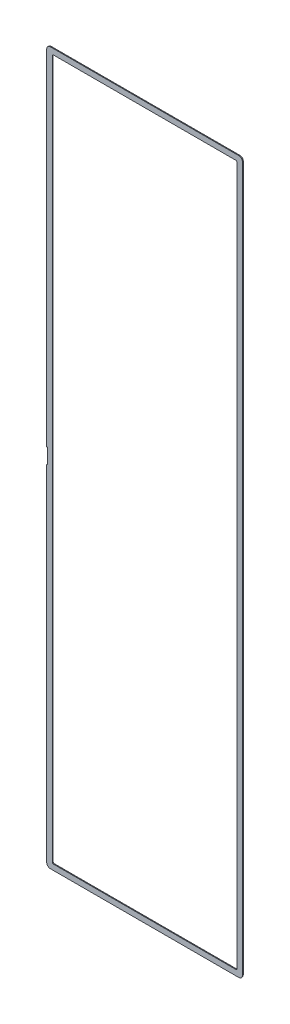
ISO-10303-21;
HEADER;
FILE_DESCRIPTION(('STEP AP214'),'2;1');
FILE_NAME('part.step','',(''),(''),'','','');
FILE_SCHEMA(('AUTOMOTIVE_DESIGN { 1 0 10303 214 1 1 1 1 }'));
ENDSEC;
DATA;
#1=APPLICATION_CONTEXT('core data for automotive mechanical design processes');
#2=APPLICATION_PROTOCOL_DEFINITION('international standard','automotive_design',2000,#1);
#3=PRODUCT_CONTEXT('',#1,'mechanical');
#4=PRODUCT('Part','Part','',(#3));
#5=PRODUCT_RELATED_PRODUCT_CATEGORY('part','',(#4));
#6=PRODUCT_DEFINITION_FORMATION('','',#4);
#7=PRODUCT_DEFINITION_CONTEXT('part definition',#1,'design');
#8=PRODUCT_DEFINITION('design','',#6,#7);
#9=PRODUCT_DEFINITION_SHAPE('','',#8);
#10=(LENGTH_UNIT() NAMED_UNIT(*) SI_UNIT(.MILLI.,.METRE.));
#11=(NAMED_UNIT(*) PLANE_ANGLE_UNIT() SI_UNIT($,.RADIAN.));
#12=(NAMED_UNIT(*) SI_UNIT($,.STERADIAN.) SOLID_ANGLE_UNIT());
#13=UNCERTAINTY_MEASURE_WITH_UNIT(LENGTH_MEASURE(1.E-05),#10,'distance_accuracy_value','');
#14=(GEOMETRIC_REPRESENTATION_CONTEXT(3) GLOBAL_UNCERTAINTY_ASSIGNED_CONTEXT((#13)) GLOBAL_UNIT_ASSIGNED_CONTEXT((#10,
#11,#12)) REPRESENTATION_CONTEXT('',''));
#15=CARTESIAN_POINT('',(0.,0.,0.));
#16=DIRECTION('',(0.,0.,1.));
#17=DIRECTION('',(1.,0.,0.));
#18=AXIS2_PLACEMENT_3D('',#15,#16,#17);
#19=CARTESIAN_POINT('',(-265.5,-955.5,4.));
#20=DIRECTION('',(1.,0.,0.));
#21=DIRECTION('',(0.,0.,-1.));
#22=AXIS2_PLACEMENT_3D('',#19,#20,#21);
#23=PLANE('',#22);
#24=DIRECTION('',(0.,-1.,0.));
#25=VECTOR('',#24,1.);
#26=CARTESIAN_POINT('',(-265.5,-955.5,4.));
#27=LINE('',#26,#25);
#28=CARTESIAN_POINT('',(-265.5,-20.5000000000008,4.));
#29=VERTEX_POINT('',#28);
#30=CARTESIAN_POINT('',(-265.5,-955.5,4.));
#31=VERTEX_POINT('',#30);
#32=EDGE_CURVE('E275',#29,#31,#27,.T.);
#33=ORIENTED_EDGE('',*,*,#32,.F.);
#34=DIRECTION('',(0.,0.,-1.));
#35=VECTOR('',#34,1.);
#36=CARTESIAN_POINT('',(-265.5,-20.5000000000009,4.));
#37=LINE('',#36,#35);
#38=CARTESIAN_POINT('',(-265.5,-20.5000000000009,3.));
#39=VERTEX_POINT('',#38);
#40=EDGE_CURVE('E243',#29,#39,#37,.T.);
#41=ORIENTED_EDGE('',*,*,#40,.T.);
#42=DIRECTION('',(0.,-1.,0.));
#43=VECTOR('',#42,1.);
#44=CARTESIAN_POINT('',(-265.5,-955.5,3.));
#45=LINE('',#44,#43);
#46=CARTESIAN_POINT('',(-265.5,-955.5,3.));
#47=VERTEX_POINT('',#46);
#48=EDGE_CURVE('E341',#39,#47,#45,.T.);
#49=ORIENTED_EDGE('',*,*,#48,.T.);
#50=DIRECTION('',(0.,0.,-1.));
#51=VECTOR('',#50,1.);
#52=CARTESIAN_POINT('',(-265.5,-955.5,4.));
#53=LINE('',#52,#51);
#54=EDGE_CURVE('E277',#31,#47,#53,.T.);
#55=ORIENTED_EDGE('',*,*,#54,.F.);
#56=EDGE_LOOP('',(#33,#41,#49,#55));
#57=FACE_BOUND('',#56,.T.);
#58=ADVANCED_FACE('F32',(#57),#23,.F.);
#59=CARTESIAN_POINT('',(-255.5,-955.5,0.));
#60=DIRECTION('',(0.,0.,-1.));
#61=DIRECTION('',(-1.,0.,0.));
#62=AXIS2_PLACEMENT_3D('',#59,#60,#61);
#63=PLANE('',#62);
#64=DIRECTION('',(1.,0.,0.));
#65=VECTOR('',#64,1.);
#66=CARTESIAN_POINT('',(-255.5,-962.5,0.));
#67=LINE('',#66,#65);
#68=CARTESIAN_POINT('',(255.5,-962.5,0.));
#69=VERTEX_POINT('',#68);
#70=CARTESIAN_POINT('',(-255.5,-962.5,0.));
#71=VERTEX_POINT('',#70);
#72=EDGE_CURVE('E324',#69,#71,#67,.F.);
#73=ORIENTED_EDGE('',*,*,#72,.T.);
#74=CARTESIAN_POINT('',(-255.5,-955.5,0.));
#75=DIRECTION('',(0.,0.,-1.));
#76=DIRECTION('',(-1.,0.,0.));
#77=AXIS2_PLACEMENT_3D('',#74,#75,#76);
#78=CIRCLE('',#77,7.00000000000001);
#79=CARTESIAN_POINT('',(-262.5,-955.5,0.));
#80=VERTEX_POINT('',#79);
#81=EDGE_CURVE('E338',#71,#80,#78,.T.);
#82=ORIENTED_EDGE('',*,*,#81,.T.);
#83=DIRECTION('',(0.,-1.,0.));
#84=VECTOR('',#83,1.);
#85=CARTESIAN_POINT('',(-262.5,955.5,0.));
#86=LINE('',#85,#84);
#87=CARTESIAN_POINT('',(-262.5,955.5,0.));
#88=VERTEX_POINT('',#87);
#89=EDGE_CURVE('E336',#80,#88,#86,.F.);
#90=ORIENTED_EDGE('',*,*,#89,.T.);
#91=CARTESIAN_POINT('',(-255.5,955.5,0.));
#92=DIRECTION('',(0.,0.,-1.));
#93=DIRECTION('',(-1.,0.,0.));
#94=AXIS2_PLACEMENT_3D('',#91,#92,#93);
#95=CIRCLE('',#94,7.00000000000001);
#96=CARTESIAN_POINT('',(-255.5,962.5,0.));
#97=VERTEX_POINT('',#96);
#98=EDGE_CURVE('E334',#88,#97,#95,.T.);
#99=ORIENTED_EDGE('',*,*,#98,.T.);
#100=DIRECTION('',(-1.,0.,0.));
#101=VECTOR('',#100,1.);
#102=CARTESIAN_POINT('',(255.5,962.5,0.));
#103=LINE('',#102,#101);
#104=CARTESIAN_POINT('',(255.5,962.5,0.));
#105=VERTEX_POINT('',#104);
#106=EDGE_CURVE('E332',#97,#105,#103,.F.);
#107=ORIENTED_EDGE('',*,*,#106,.T.);
#108=CARTESIAN_POINT('',(255.5,955.5,0.));
#109=DIRECTION('',(0.,0.,-1.));
#110=DIRECTION('',(-1.,0.,0.));
#111=AXIS2_PLACEMENT_3D('',#108,#109,#110);
#112=CIRCLE('',#111,7.00000000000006);
#113=CARTESIAN_POINT('',(262.5,955.5,0.));
#114=VERTEX_POINT('',#113);
#115=EDGE_CURVE('E330',#105,#114,#112,.T.);
#116=ORIENTED_EDGE('',*,*,#115,.T.);
#117=DIRECTION('',(0.,1.,0.));
#118=VECTOR('',#117,1.);
#119=CARTESIAN_POINT('',(262.5,-955.5,0.));
#120=LINE('',#119,#118);
#121=CARTESIAN_POINT('',(262.5,-955.5,0.));
#122=VERTEX_POINT('',#121);
#123=EDGE_CURVE('E328',#114,#122,#120,.F.);
#124=ORIENTED_EDGE('',*,*,#123,.T.);
#125=CARTESIAN_POINT('',(255.5,-955.5,0.));
#126=DIRECTION('',(0.,0.,-1.));
#127=DIRECTION('',(-1.,0.,0.));
#128=AXIS2_PLACEMENT_3D('',#125,#126,#127);
#129=CIRCLE('',#128,7.00000000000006);
#130=EDGE_CURVE('E326',#122,#69,#129,.T.);
#131=ORIENTED_EDGE('',*,*,#130,.T.);
#132=EDGE_LOOP('',(#73,#82,#90,#99,#107,#116,#124,#131));
#133=FACE_BOUND('',#132,.T.);
#134=CARTESIAN_POINT('',(-247.5,-947.5,0.));
#135=DIRECTION('',(0.,0.,-1.));
#136=DIRECTION('',(-1.,0.,0.));
#137=AXIS2_PLACEMENT_3D('',#134,#135,#136);
#138=CIRCLE('',#137,6.);
#139=CARTESIAN_POINT('',(-247.5,-953.5,0.));
#140=VERTEX_POINT('',#139);
#141=CARTESIAN_POINT('',(-253.5,-947.5,0.));
#142=VERTEX_POINT('',#141);
#143=EDGE_CURVE('E321',#140,#142,#138,.T.);
#144=ORIENTED_EDGE('',*,*,#143,.F.);
#145=DIRECTION('',(1.,0.,0.));
#146=VECTOR('',#145,1.);
#147=CARTESIAN_POINT('',(-255.5,-953.5,0.));
#148=LINE('',#147,#146);
#149=CARTESIAN_POINT('',(247.5,-953.5,0.));
#150=VERTEX_POINT('',#149);
#151=EDGE_CURVE('E318',#140,#150,#148,.T.);
#152=ORIENTED_EDGE('',*,*,#151,.T.);
#153=CARTESIAN_POINT('',(247.5,-947.5,0.));
#154=DIRECTION('',(0.,0.,-1.));
#155=DIRECTION('',(-1.,0.,0.));
#156=AXIS2_PLACEMENT_3D('',#153,#154,#155);
#157=CIRCLE('',#156,6.);
#158=CARTESIAN_POINT('',(253.5,-947.5,0.));
#159=VERTEX_POINT('',#158);
#160=EDGE_CURVE('E316',#159,#150,#157,.T.);
#161=ORIENTED_EDGE('',*,*,#160,.F.);
#162=DIRECTION('',(0.,1.,0.));
#163=VECTOR('',#162,1.);
#164=CARTESIAN_POINT('',(253.5,-955.5,0.));
#165=LINE('',#164,#163);
#166=CARTESIAN_POINT('',(253.5,947.5,0.));
#167=VERTEX_POINT('',#166);
#168=EDGE_CURVE('E312',#159,#167,#165,.T.);
#169=ORIENTED_EDGE('',*,*,#168,.T.);
#170=CARTESIAN_POINT('',(247.5,947.5,0.));
#171=DIRECTION('',(0.,0.,-1.));
#172=DIRECTION('',(-1.,0.,0.));
#173=AXIS2_PLACEMENT_3D('',#170,#171,#172);
#174=CIRCLE('',#173,6.);
#175=CARTESIAN_POINT('',(247.5,953.5,0.));
#176=VERTEX_POINT('',#175);
#177=EDGE_CURVE('E309',#176,#167,#174,.T.);
#178=ORIENTED_EDGE('',*,*,#177,.F.);
#179=DIRECTION('',(-1.,0.,0.));
#180=VECTOR('',#179,1.);
#181=CARTESIAN_POINT('',(-255.5,953.5,0.));
#182=LINE('',#181,#180);
#183=CARTESIAN_POINT('',(-247.5,953.5,0.));
#184=VERTEX_POINT('',#183);
#185=EDGE_CURVE('E307',#176,#184,#182,.T.);
#186=ORIENTED_EDGE('',*,*,#185,.T.);
#187=CARTESIAN_POINT('',(-247.5,947.5,0.));
#188=DIRECTION('',(0.,0.,-1.));
#189=DIRECTION('',(-1.,0.,0.));
#190=AXIS2_PLACEMENT_3D('',#187,#188,#189);
#191=CIRCLE('',#190,6.);
#192=CARTESIAN_POINT('',(-253.5,947.5,0.));
#193=VERTEX_POINT('',#192);
#194=EDGE_CURVE('E304',#193,#184,#191,.T.);
#195=ORIENTED_EDGE('',*,*,#194,.F.);
#196=DIRECTION('',(0.,-1.,0.));
#197=VECTOR('',#196,1.);
#198=CARTESIAN_POINT('',(-253.5,-955.5,0.));
#199=LINE('',#198,#197);
#200=EDGE_CURVE('E314',#193,#142,#199,.T.);
#201=ORIENTED_EDGE('',*,*,#200,.T.);
#202=EDGE_LOOP('',(#144,#152,#161,#169,#178,#186,#195,#201));
#203=FACE_BOUND('',#202,.T.);
#204=ADVANCED_FACE('F500',(#133,#203),#63,.T.);
#205=CARTESIAN_POINT('',(-255.5,-955.5,4.));
#206=DIRECTION('',(0.,0.,-1.));
#207=DIRECTION('',(-1.,0.,0.));
#208=AXIS2_PLACEMENT_3D('',#205,#206,#207);
#209=PLANE('',#208);
#210=DIRECTION('',(0.,1.,0.));
#211=VECTOR('',#210,1.);
#212=CARTESIAN_POINT('',(-263.173399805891,20.4999999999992,4.));
#213=LINE('',#212,#211);
#214=CARTESIAN_POINT('',(-263.173399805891,-20.5000000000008,4.));
#215=VERTEX_POINT('',#214);
#216=CARTESIAN_POINT('',(-263.173399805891,20.4999999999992,4.));
#217=VERTEX_POINT('',#216);
#218=EDGE_CURVE('E226',#215,#217,#213,.T.);
#219=ORIENTED_EDGE('',*,*,#218,.F.);
#220=DIRECTION('',(1.,0.,0.));
#221=VECTOR('',#220,1.);
#222=CARTESIAN_POINT('',(-263.173399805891,-20.5000000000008,4.));
#223=LINE('',#222,#221);
#224=EDGE_CURVE('E223',#29,#215,#223,.T.);
#225=ORIENTED_EDGE('',*,*,#224,.F.);
#226=ORIENTED_EDGE('',*,*,#32,.T.);
#227=CARTESIAN_POINT('',(-255.5,-955.5,4.));
#228=DIRECTION('',(0.,0.,1.));
#229=DIRECTION('',(-1.,0.,0.));
#230=AXIS2_PLACEMENT_3D('',#227,#228,#229);
#231=CIRCLE('',#230,10.);
#232=CARTESIAN_POINT('',(-255.5,-965.5,4.));
#233=VERTEX_POINT('',#232);
#234=EDGE_CURVE('E260',#31,#233,#231,.T.);
#235=ORIENTED_EDGE('',*,*,#234,.T.);
#236=DIRECTION('',(1.,0.,0.));
#237=VECTOR('',#236,1.);
#238=CARTESIAN_POINT('',(-255.5,-965.5,4.));
#239=LINE('',#238,#237);
#240=CARTESIAN_POINT('',(255.5,-965.5,4.));
#241=VERTEX_POINT('',#240);
#242=EDGE_CURVE('E263',#233,#241,#239,.T.);
#243=ORIENTED_EDGE('',*,*,#242,.T.);
#244=CARTESIAN_POINT('',(255.5,-955.5,4.));
#245=DIRECTION('',(0.,0.,1.));
#246=DIRECTION('',(1.,0.,0.));
#247=AXIS2_PLACEMENT_3D('',#244,#245,#246);
#248=CIRCLE('',#247,10.0000000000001);
#249=CARTESIAN_POINT('',(265.5,-955.5,4.));
#250=VERTEX_POINT('',#249);
#251=EDGE_CURVE('E265',#241,#250,#248,.T.);
#252=ORIENTED_EDGE('',*,*,#251,.T.);
#253=DIRECTION('',(0.,1.,0.));
#254=VECTOR('',#253,1.);
#255=CARTESIAN_POINT('',(265.5,-955.5,4.));
#256=LINE('',#255,#254);
#257=CARTESIAN_POINT('',(265.5,955.5,4.));
#258=VERTEX_POINT('',#257);
#259=EDGE_CURVE('E267',#250,#258,#256,.T.);
#260=ORIENTED_EDGE('',*,*,#259,.T.);
#261=CARTESIAN_POINT('',(255.5,955.5,4.));
#262=DIRECTION('',(0.,0.,1.));
#263=DIRECTION('',(-1.,0.,0.));
#264=AXIS2_PLACEMENT_3D('',#261,#262,#263);
#265=CIRCLE('',#264,10.0000000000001);
#266=CARTESIAN_POINT('',(255.5,965.5,4.));
#267=VERTEX_POINT('',#266);
#268=EDGE_CURVE('E269',#258,#267,#265,.T.);
#269=ORIENTED_EDGE('',*,*,#268,.T.);
#270=DIRECTION('',(-1.,0.,0.));
#271=VECTOR('',#270,1.);
#272=CARTESIAN_POINT('',(-255.5,965.5,4.));
#273=LINE('',#272,#271);
#274=CARTESIAN_POINT('',(-255.5,965.5,4.));
#275=VERTEX_POINT('',#274);
#276=EDGE_CURVE('E271',#267,#275,#273,.T.);
#277=ORIENTED_EDGE('',*,*,#276,.T.);
#278=CARTESIAN_POINT('',(-255.5,955.5,4.));
#279=DIRECTION('',(0.,0.,1.));
#280=DIRECTION('',(-1.,0.,0.));
#281=AXIS2_PLACEMENT_3D('',#278,#279,#280);
#282=CIRCLE('',#281,10.);
#283=CARTESIAN_POINT('',(-265.5,955.5,4.));
#284=VERTEX_POINT('',#283);
#285=EDGE_CURVE('E273',#275,#284,#282,.T.);
#286=ORIENTED_EDGE('',*,*,#285,.T.);
#287=CARTESIAN_POINT('',(-265.5,20.4999999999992,4.));
#288=VERTEX_POINT('',#287);
#289=EDGE_CURVE('E237',#284,#288,#27,.T.);
#290=ORIENTED_EDGE('',*,*,#289,.T.);
#291=DIRECTION('',(-1.,0.,0.));
#292=VECTOR('',#291,1.);
#293=CARTESIAN_POINT('',(-263.173399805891,20.4999999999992,4.));
#294=LINE('',#293,#292);
#295=EDGE_CURVE('E218',#217,#288,#294,.T.);
#296=ORIENTED_EDGE('',*,*,#295,.F.);
#297=EDGE_LOOP('',(#219,#225,#226,#235,#243,#252,#260,#269,#277,#286,#290,#296));
#298=FACE_BOUND('',#297,.T.);
#299=DIRECTION('',(1.,0.,0.));
#300=VECTOR('',#299,1.);
#301=CARTESIAN_POINT('',(-250.5,-950.5,4.));
#302=LINE('',#301,#300);
#303=CARTESIAN_POINT('',(-247.5,-950.5,4.));
#304=VERTEX_POINT('',#303);
#305=CARTESIAN_POINT('',(247.5,-950.5,4.));
#306=VERTEX_POINT('',#305);
#307=EDGE_CURVE('E247',#304,#306,#302,.T.);
#308=ORIENTED_EDGE('',*,*,#307,.F.);
#309=CARTESIAN_POINT('',(-247.5,-947.5,4.));
#310=DIRECTION('',(0.,0.,-1.));
#311=DIRECTION('',(-1.,0.,0.));
#312=AXIS2_PLACEMENT_3D('',#309,#310,#311);
#313=CIRCLE('',#312,3.);
#314=CARTESIAN_POINT('',(-250.5,-947.5,4.));
#315=VERTEX_POINT('',#314);
#316=EDGE_CURVE('E383',#304,#315,#313,.T.);
#317=ORIENTED_EDGE('',*,*,#316,.T.);
#318=DIRECTION('',(0.,-1.,0.));
#319=VECTOR('',#318,1.);
#320=CARTESIAN_POINT('',(-250.5,-950.5,4.));
#321=LINE('',#320,#319);
#322=CARTESIAN_POINT('',(-250.5,947.5,4.));
#323=VERTEX_POINT('',#322);
#324=EDGE_CURVE('E257',#323,#315,#321,.T.);
#325=ORIENTED_EDGE('',*,*,#324,.F.);
#326=CARTESIAN_POINT('',(-247.5,947.5,4.));
#327=DIRECTION('',(0.,0.,-1.));
#328=DIRECTION('',(-1.,0.,0.));
#329=AXIS2_PLACEMENT_3D('',#326,#327,#328);
#330=CIRCLE('',#329,3.);
#331=CARTESIAN_POINT('',(-247.5,950.5,4.));
#332=VERTEX_POINT('',#331);
#333=EDGE_CURVE('E385',#323,#332,#330,.T.);
#334=ORIENTED_EDGE('',*,*,#333,.T.);
#335=DIRECTION('',(-1.,0.,0.));
#336=VECTOR('',#335,1.);
#337=CARTESIAN_POINT('',(-250.5,950.5,4.));
#338=LINE('',#337,#336);
#339=CARTESIAN_POINT('',(247.5,950.5,4.));
#340=VERTEX_POINT('',#339);
#341=EDGE_CURVE('E254',#340,#332,#338,.T.);
#342=ORIENTED_EDGE('',*,*,#341,.F.);
#343=CARTESIAN_POINT('',(247.5,947.5,4.));
#344=DIRECTION('',(0.,0.,-1.));
#345=DIRECTION('',(-1.,0.,0.));
#346=AXIS2_PLACEMENT_3D('',#343,#344,#345);
#347=CIRCLE('',#346,3.);
#348=CARTESIAN_POINT('',(250.5,947.5,4.));
#349=VERTEX_POINT('',#348);
#350=EDGE_CURVE('E387',#340,#349,#347,.T.);
#351=ORIENTED_EDGE('',*,*,#350,.T.);
#352=DIRECTION('',(0.,1.,0.));
#353=VECTOR('',#352,1.);
#354=CARTESIAN_POINT('',(250.5,-950.5,4.));
#355=LINE('',#354,#353);
#356=CARTESIAN_POINT('',(250.5,-947.5,4.));
#357=VERTEX_POINT('',#356);
#358=EDGE_CURVE('E250',#357,#349,#355,.T.);
#359=ORIENTED_EDGE('',*,*,#358,.F.);
#360=CARTESIAN_POINT('',(247.5,-947.5,4.));
#361=DIRECTION('',(0.,0.,-1.));
#362=DIRECTION('',(-1.,0.,0.));
#363=AXIS2_PLACEMENT_3D('',#360,#361,#362);
#364=CIRCLE('',#363,3.);
#365=EDGE_CURVE('E381',#357,#306,#364,.T.);
#366=ORIENTED_EDGE('',*,*,#365,.T.);
#367=EDGE_LOOP('',(#308,#317,#325,#334,#342,#351,#359,#366));
#368=FACE_BOUND('',#367,.T.);
#369=ADVANCED_FACE('F234',(#298,#368),#209,.F.);
#370=CARTESIAN_POINT('',(-255.5,-955.5,4.));
#371=DIRECTION('',(0.,0.,-1.));
#372=DIRECTION('',(-1.,0.,0.));
#373=AXIS2_PLACEMENT_3D('',#370,#371,#372);
#374=CYLINDRICAL_SURFACE('',#373,10.);
#375=ORIENTED_EDGE('',*,*,#54,.T.);
#376=CARTESIAN_POINT('',(-255.5,-955.5,3.));
#377=DIRECTION('',(0.,0.,-1.));
#378=DIRECTION('',(-1.,0.,0.));
#379=AXIS2_PLACEMENT_3D('',#376,#377,#378);
#380=CIRCLE('',#379,10.);
#381=CARTESIAN_POINT('',(-255.5,-965.5,3.));
#382=VERTEX_POINT('',#381);
#383=EDGE_CURVE('E301',#47,#382,#380,.F.);
#384=ORIENTED_EDGE('',*,*,#383,.T.);
#385=DIRECTION('',(0.,0.,-1.));
#386=VECTOR('',#385,1.);
#387=CARTESIAN_POINT('',(-255.5,-965.5,4.));
#388=LINE('',#387,#386);
#389=EDGE_CURVE('E298',#233,#382,#388,.T.);
#390=ORIENTED_EDGE('',*,*,#389,.F.);
#391=ORIENTED_EDGE('',*,*,#234,.F.);
#392=EDGE_LOOP('',(#375,#384,#390,#391));
#393=FACE_BOUND('',#392,.T.);
#394=ADVANCED_FACE('F458',(#393),#374,.T.);
#395=CARTESIAN_POINT('',(-255.5,-965.5,4.));
#396=DIRECTION('',(0.,1.,0.));
#397=DIRECTION('',(0.,0.,1.));
#398=AXIS2_PLACEMENT_3D('',#395,#396,#397);
#399=PLANE('',#398);
#400=ORIENTED_EDGE('',*,*,#389,.T.);
#401=DIRECTION('',(1.,0.,0.));
#402=VECTOR('',#401,1.);
#403=CARTESIAN_POINT('',(255.5,-965.5,3.));
#404=LINE('',#403,#402);
#405=CARTESIAN_POINT('',(255.5,-965.5,3.));
#406=VERTEX_POINT('',#405);
#407=EDGE_CURVE('E355',#382,#406,#404,.T.);
#408=ORIENTED_EDGE('',*,*,#407,.T.);
#409=DIRECTION('',(0.,0.,-1.));
#410=VECTOR('',#409,1.);
#411=CARTESIAN_POINT('',(255.5,-965.5,4.));
#412=LINE('',#411,#410);
#413=EDGE_CURVE('E295',#241,#406,#412,.T.);
#414=ORIENTED_EDGE('',*,*,#413,.F.);
#415=ORIENTED_EDGE('',*,*,#242,.F.);
#416=EDGE_LOOP('',(#400,#408,#414,#415));
#417=FACE_BOUND('',#416,.T.);
#418=ADVANCED_FACE('F464',(#417),#399,.F.);
#419=CARTESIAN_POINT('',(255.5,-955.5,4.));
#420=DIRECTION('',(0.,0.,-1.));
#421=DIRECTION('',(-1.,0.,0.));
#422=AXIS2_PLACEMENT_3D('',#419,#420,#421);
#423=CYLINDRICAL_SURFACE('',#422,10.0000000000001);
#424=ORIENTED_EDGE('',*,*,#413,.T.);
#425=CARTESIAN_POINT('',(255.5,-955.5,3.));
#426=DIRECTION('',(0.,0.,-1.));
#427=DIRECTION('',(-1.,0.,0.));
#428=AXIS2_PLACEMENT_3D('',#425,#426,#427);
#429=CIRCLE('',#428,10.0000000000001);
#430=CARTESIAN_POINT('',(265.5,-955.5,3.));
#431=VERTEX_POINT('',#430);
#432=EDGE_CURVE('E353',#406,#431,#429,.F.);
#433=ORIENTED_EDGE('',*,*,#432,.T.);
#434=DIRECTION('',(0.,0.,-1.));
#435=VECTOR('',#434,1.);
#436=CARTESIAN_POINT('',(265.5,-955.5,4.));
#437=LINE('',#436,#435);
#438=EDGE_CURVE('E292',#250,#431,#437,.T.);
#439=ORIENTED_EDGE('',*,*,#438,.F.);
#440=ORIENTED_EDGE('',*,*,#251,.F.);
#441=EDGE_LOOP('',(#424,#433,#439,#440));
#442=FACE_BOUND('',#441,.T.);
#443=ADVANCED_FACE('F468',(#442),#423,.T.);
#444=CARTESIAN_POINT('',(265.5,-955.5,4.));
#445=DIRECTION('',(-1.,0.,0.));
#446=DIRECTION('',(0.,0.,1.));
#447=AXIS2_PLACEMENT_3D('',#444,#445,#446);
#448=PLANE('',#447);
#449=ORIENTED_EDGE('',*,*,#438,.T.);
#450=DIRECTION('',(0.,1.,0.));
#451=VECTOR('',#450,1.);
#452=CARTESIAN_POINT('',(265.5,955.5,3.));
#453=LINE('',#452,#451);
#454=CARTESIAN_POINT('',(265.5,955.5,3.));
#455=VERTEX_POINT('',#454);
#456=EDGE_CURVE('E351',#431,#455,#453,.T.);
#457=ORIENTED_EDGE('',*,*,#456,.T.);
#458=DIRECTION('',(0.,0.,-1.));
#459=VECTOR('',#458,1.);
#460=CARTESIAN_POINT('',(265.5,955.5,4.));
#461=LINE('',#460,#459);
#462=EDGE_CURVE('E289',#258,#455,#461,.T.);
#463=ORIENTED_EDGE('',*,*,#462,.F.);
#464=ORIENTED_EDGE('',*,*,#259,.F.);
#465=EDGE_LOOP('',(#449,#457,#463,#464));
#466=FACE_BOUND('',#465,.T.);
#467=ADVANCED_FACE('F473',(#466),#448,.F.);
#468=CARTESIAN_POINT('',(255.5,955.5,4.));
#469=DIRECTION('',(0.,0.,-1.));
#470=DIRECTION('',(-1.,0.,0.));
#471=AXIS2_PLACEMENT_3D('',#468,#469,#470);
#472=CYLINDRICAL_SURFACE('',#471,10.0000000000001);
#473=ORIENTED_EDGE('',*,*,#462,.T.);
#474=CARTESIAN_POINT('',(255.5,955.5,3.));
#475=DIRECTION('',(0.,0.,-1.));
#476=DIRECTION('',(-1.,0.,0.));
#477=AXIS2_PLACEMENT_3D('',#474,#475,#476);
#478=CIRCLE('',#477,10.0000000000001);
#479=CARTESIAN_POINT('',(255.5,965.5,3.));
#480=VERTEX_POINT('',#479);
#481=EDGE_CURVE('E349',#455,#480,#478,.F.);
#482=ORIENTED_EDGE('',*,*,#481,.T.);
#483=DIRECTION('',(0.,0.,-1.));
#484=VECTOR('',#483,1.);
#485=CARTESIAN_POINT('',(255.5,965.5,4.));
#486=LINE('',#485,#484);
#487=EDGE_CURVE('E286',#267,#480,#486,.T.);
#488=ORIENTED_EDGE('',*,*,#487,.F.);
#489=ORIENTED_EDGE('',*,*,#268,.F.);
#490=EDGE_LOOP('',(#473,#482,#488,#489));
#491=FACE_BOUND('',#490,.T.);
#492=ADVANCED_FACE('F479',(#491),#472,.T.);
#493=CARTESIAN_POINT('',(-255.5,965.5,4.));
#494=DIRECTION('',(0.,-1.,0.));
#495=DIRECTION('',(0.,0.,-1.));
#496=AXIS2_PLACEMENT_3D('',#493,#494,#495);
#497=PLANE('',#496);
#498=ORIENTED_EDGE('',*,*,#487,.T.);
#499=DIRECTION('',(-1.,0.,0.));
#500=VECTOR('',#499,1.);
#501=CARTESIAN_POINT('',(-255.5,965.5,3.));
#502=LINE('',#501,#500);
#503=CARTESIAN_POINT('',(-255.5,965.5,3.));
#504=VERTEX_POINT('',#503);
#505=EDGE_CURVE('E347',#480,#504,#502,.T.);
#506=ORIENTED_EDGE('',*,*,#505,.T.);
#507=DIRECTION('',(0.,0.,-1.));
#508=VECTOR('',#507,1.);
#509=CARTESIAN_POINT('',(-255.5,965.5,4.));
#510=LINE('',#509,#508);
#511=EDGE_CURVE('E283',#275,#504,#510,.T.);
#512=ORIENTED_EDGE('',*,*,#511,.F.);
#513=ORIENTED_EDGE('',*,*,#276,.F.);
#514=EDGE_LOOP('',(#498,#506,#512,#513));
#515=FACE_BOUND('',#514,.T.);
#516=ADVANCED_FACE('F483',(#515),#497,.F.);
#517=CARTESIAN_POINT('',(-255.5,955.5,4.));
#518=DIRECTION('',(0.,0.,-1.));
#519=DIRECTION('',(-1.,0.,0.));
#520=AXIS2_PLACEMENT_3D('',#517,#518,#519);
#521=CYLINDRICAL_SURFACE('',#520,10.);
#522=ORIENTED_EDGE('',*,*,#511,.T.);
#523=CARTESIAN_POINT('',(-255.5,955.5,3.));
#524=DIRECTION('',(0.,0.,-1.));
#525=DIRECTION('',(-1.,0.,0.));
#526=AXIS2_PLACEMENT_3D('',#523,#524,#525);
#527=CIRCLE('',#526,10.);
#528=CARTESIAN_POINT('',(-265.5,955.5,3.));
#529=VERTEX_POINT('',#528);
#530=EDGE_CURVE('E345',#504,#529,#527,.F.);
#531=ORIENTED_EDGE('',*,*,#530,.T.);
#532=DIRECTION('',(0.,0.,-1.));
#533=VECTOR('',#532,1.);
#534=CARTESIAN_POINT('',(-265.5,955.5,4.));
#535=LINE('',#534,#533);
#536=EDGE_CURVE('E280',#284,#529,#535,.T.);
#537=ORIENTED_EDGE('',*,*,#536,.F.);
#538=ORIENTED_EDGE('',*,*,#285,.F.);
#539=EDGE_LOOP('',(#522,#531,#537,#538));
#540=FACE_BOUND('',#539,.T.);
#541=ADVANCED_FACE('F489',(#540),#521,.T.);
#542=CARTESIAN_POINT('',(-265.5,20.4999999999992,3.));
#543=VERTEX_POINT('',#542);
#544=EDGE_CURVE('E342',#529,#543,#45,.T.);
#545=ORIENTED_EDGE('',*,*,#544,.T.);
#546=DIRECTION('',(0.,0.,1.));
#547=VECTOR('',#546,1.);
#548=CARTESIAN_POINT('',(-265.5,20.4999999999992,4.));
#549=LINE('',#548,#547);
#550=EDGE_CURVE('E47',#543,#288,#549,.T.);
#551=ORIENTED_EDGE('',*,*,#550,.T.);
#552=ORIENTED_EDGE('',*,*,#289,.F.);
#553=ORIENTED_EDGE('',*,*,#536,.T.);
#554=EDGE_LOOP('',(#545,#551,#552,#553));
#555=FACE_BOUND('',#554,.T.);
#556=ADVANCED_FACE('F493',(#555),#23,.F.);
#557=CARTESIAN_POINT('',(-250.5,-950.5,4.));
#558=DIRECTION('',(0.,1.,0.));
#559=DIRECTION('',(0.,0.,1.));
#560=AXIS2_PLACEMENT_3D('',#557,#558,#559);
#561=PLANE('',#560);
#562=ORIENTED_EDGE('',*,*,#307,.T.);
#563=DIRECTION('',(0.,0.,-1.));
#564=VECTOR('',#563,1.);
#565=CARTESIAN_POINT('',(247.5,-950.5,0.));
#566=LINE('',#565,#564);
#567=CARTESIAN_POINT('',(247.5,-950.5,3.));
#568=VERTEX_POINT('',#567);
#569=EDGE_CURVE('E361',#306,#568,#566,.T.);
#570=ORIENTED_EDGE('',*,*,#569,.T.);
#571=DIRECTION('',(1.,0.,0.));
#572=VECTOR('',#571,1.);
#573=CARTESIAN_POINT('',(-250.5,-950.5,3.));
#574=LINE('',#573,#572);
#575=CARTESIAN_POINT('',(-247.5,-950.5,3.));
#576=VERTEX_POINT('',#575);
#577=EDGE_CURVE('E357',#568,#576,#574,.F.);
#578=ORIENTED_EDGE('',*,*,#577,.T.);
#579=DIRECTION('',(0.,0.,-1.));
#580=VECTOR('',#579,1.);
#581=CARTESIAN_POINT('',(-247.5,-950.5,4.));
#582=LINE('',#581,#580);
#583=EDGE_CURVE('E359',#576,#304,#582,.F.);
#584=ORIENTED_EDGE('',*,*,#583,.T.);
#585=EDGE_LOOP('',(#562,#570,#578,#584));
#586=FACE_BOUND('',#585,.T.);
#587=ADVANCED_FACE('F541',(#586),#561,.T.);
#588=CARTESIAN_POINT('',(250.5,-950.5,4.));
#589=DIRECTION('',(-1.,0.,0.));
#590=DIRECTION('',(0.,0.,1.));
#591=AXIS2_PLACEMENT_3D('',#588,#589,#590);
#592=PLANE('',#591);
#593=DIRECTION('',(0.,1.,0.));
#594=VECTOR('',#593,1.);
#595=CARTESIAN_POINT('',(250.5,-950.5,3.));
#596=LINE('',#595,#594);
#597=CARTESIAN_POINT('',(250.5,947.5,3.));
#598=VERTEX_POINT('',#597);
#599=CARTESIAN_POINT('',(250.5,-947.5,3.));
#600=VERTEX_POINT('',#599);
#601=EDGE_CURVE('E364',#598,#600,#596,.F.);
#602=ORIENTED_EDGE('',*,*,#601,.T.);
#603=DIRECTION('',(0.,0.,-1.));
#604=VECTOR('',#603,1.);
#605=CARTESIAN_POINT('',(250.5,-947.5,4.));
#606=LINE('',#605,#604);
#607=EDGE_CURVE('E368',#600,#357,#606,.F.);
#608=ORIENTED_EDGE('',*,*,#607,.T.);
#609=ORIENTED_EDGE('',*,*,#358,.T.);
#610=DIRECTION('',(0.,0.,-1.));
#611=VECTOR('',#610,1.);
#612=CARTESIAN_POINT('',(250.5,947.5,0.));
#613=LINE('',#612,#611);
#614=EDGE_CURVE('E366',#349,#598,#613,.T.);
#615=ORIENTED_EDGE('',*,*,#614,.T.);
#616=EDGE_LOOP('',(#602,#608,#609,#615));
#617=FACE_BOUND('',#616,.T.);
#618=ADVANCED_FACE('F546',(#617),#592,.T.);
#619=CARTESIAN_POINT('',(-250.5,950.5,4.));
#620=DIRECTION('',(0.,-1.,0.));
#621=DIRECTION('',(0.,0.,-1.));
#622=AXIS2_PLACEMENT_3D('',#619,#620,#621);
#623=PLANE('',#622);
#624=ORIENTED_EDGE('',*,*,#341,.T.);
#625=DIRECTION('',(0.,0.,-1.));
#626=VECTOR('',#625,1.);
#627=CARTESIAN_POINT('',(-247.5,950.5,0.));
#628=LINE('',#627,#626);
#629=CARTESIAN_POINT('',(-247.5,950.5,3.));
#630=VERTEX_POINT('',#629);
#631=EDGE_CURVE('E379',#332,#630,#628,.T.);
#632=ORIENTED_EDGE('',*,*,#631,.T.);
#633=DIRECTION('',(-1.,0.,0.));
#634=VECTOR('',#633,1.);
#635=CARTESIAN_POINT('',(-250.5,950.5,3.));
#636=LINE('',#635,#634);
#637=CARTESIAN_POINT('',(247.5,950.5,3.));
#638=VERTEX_POINT('',#637);
#639=EDGE_CURVE('E55',#630,#638,#636,.F.);
#640=ORIENTED_EDGE('',*,*,#639,.T.);
#641=DIRECTION('',(0.,0.,-1.));
#642=VECTOR('',#641,1.);
#643=CARTESIAN_POINT('',(247.5,950.5,4.));
#644=LINE('',#643,#642);
#645=EDGE_CURVE('E377',#638,#340,#644,.F.);
#646=ORIENTED_EDGE('',*,*,#645,.T.);
#647=EDGE_LOOP('',(#624,#632,#640,#646));
#648=FACE_BOUND('',#647,.T.);
#649=ADVANCED_FACE('F571',(#648),#623,.T.);
#650=CARTESIAN_POINT('',(-250.5,-950.5,4.));
#651=DIRECTION('',(1.,0.,0.));
#652=DIRECTION('',(0.,0.,-1.));
#653=AXIS2_PLACEMENT_3D('',#650,#651,#652);
#654=PLANE('',#653);
#655=ORIENTED_EDGE('',*,*,#324,.T.);
#656=DIRECTION('',(0.,0.,-1.));
#657=VECTOR('',#656,1.);
#658=CARTESIAN_POINT('',(-250.5,-947.5,0.));
#659=LINE('',#658,#657);
#660=CARTESIAN_POINT('',(-250.5,-947.5,3.));
#661=VERTEX_POINT('',#660);
#662=EDGE_CURVE('E374',#315,#661,#659,.T.);
#663=ORIENTED_EDGE('',*,*,#662,.T.);
#664=DIRECTION('',(0.,-1.,0.));
#665=VECTOR('',#664,1.);
#666=CARTESIAN_POINT('',(-250.5,-950.5,3.));
#667=LINE('',#666,#665);
#668=CARTESIAN_POINT('',(-250.5,947.5,3.));
#669=VERTEX_POINT('',#668);
#670=EDGE_CURVE('E370',#661,#669,#667,.F.);
#671=ORIENTED_EDGE('',*,*,#670,.T.);
#672=DIRECTION('',(0.,0.,-1.));
#673=VECTOR('',#672,1.);
#674=CARTESIAN_POINT('',(-250.5,947.5,4.));
#675=LINE('',#674,#673);
#676=EDGE_CURVE('E372',#669,#323,#675,.F.);
#677=ORIENTED_EDGE('',*,*,#676,.T.);
#678=EDGE_LOOP('',(#655,#663,#671,#677));
#679=FACE_BOUND('',#678,.T.);
#680=ADVANCED_FACE('F575',(#679),#654,.T.);
#681=CARTESIAN_POINT('',(255.5,955.5,3.));
#682=DIRECTION('',(0.,0.,-1.));
#683=DIRECTION('',(-1.,0.,0.));
#684=AXIS2_PLACEMENT_3D('',#681,#682,#683);
#685=TOROIDAL_SURFACE('',#684,7.00000000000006,3.);
#686=CARTESIAN_POINT('',(262.5,955.5,3.));
#687=DIRECTION('',(0.,-1.,0.));
#688=DIRECTION('',(0.,0.,-1.));
#689=AXIS2_PLACEMENT_3D('',#686,#687,#688);
#690=CIRCLE('',#689,3.);
#691=EDGE_CURVE('E406',#114,#455,#690,.T.);
#692=ORIENTED_EDGE('',*,*,#691,.F.);
#693=ORIENTED_EDGE('',*,*,#115,.F.);
#694=CARTESIAN_POINT('',(255.5,962.5,3.));
#695=DIRECTION('',(-1.,0.,0.));
#696=DIRECTION('',(0.,0.,1.));
#697=AXIS2_PLACEMENT_3D('',#694,#695,#696);
#698=CIRCLE('',#697,3.);
#699=EDGE_CURVE('E251',#480,#105,#698,.T.);
#700=ORIENTED_EDGE('',*,*,#699,.F.);
#701=ORIENTED_EDGE('',*,*,#481,.F.);
#702=EDGE_LOOP('',(#692,#693,#700,#701));
#703=FACE_BOUND('',#702,.T.);
#704=ADVANCED_FACE('F507',(#703),#685,.T.);
#705=CARTESIAN_POINT('',(-255.5,962.5,3.));
#706=DIRECTION('',(1.,0.,0.));
#707=DIRECTION('',(0.,0.,-1.));
#708=AXIS2_PLACEMENT_3D('',#705,#706,#707);
#709=CYLINDRICAL_SURFACE('',#708,3.);
#710=ORIENTED_EDGE('',*,*,#699,.T.);
#711=ORIENTED_EDGE('',*,*,#106,.F.);
#712=CARTESIAN_POINT('',(-255.5,962.5,3.));
#713=DIRECTION('',(-1.,0.,0.));
#714=DIRECTION('',(0.,0.,1.));
#715=AXIS2_PLACEMENT_3D('',#712,#713,#714);
#716=CIRCLE('',#715,3.);
#717=EDGE_CURVE('E403',#504,#97,#716,.T.);
#718=ORIENTED_EDGE('',*,*,#717,.F.);
#719=ORIENTED_EDGE('',*,*,#505,.F.);
#720=EDGE_LOOP('',(#710,#711,#718,#719));
#721=FACE_BOUND('',#720,.T.);
#722=ADVANCED_FACE('F504',(#721),#709,.T.);
#723=CARTESIAN_POINT('',(262.5,-955.5,3.));
#724=DIRECTION('',(0.,-1.,0.));
#725=DIRECTION('',(0.,0.,-1.));
#726=AXIS2_PLACEMENT_3D('',#723,#724,#725);
#727=CYLINDRICAL_SURFACE('',#726,3.);
#728=ORIENTED_EDGE('',*,*,#691,.T.);
#729=ORIENTED_EDGE('',*,*,#456,.F.);
#730=CARTESIAN_POINT('',(262.5,-955.5,3.));
#731=DIRECTION('',(0.,-1.,0.));
#732=DIRECTION('',(0.,0.,-1.));
#733=AXIS2_PLACEMENT_3D('',#730,#731,#732);
#734=CIRCLE('',#733,3.);
#735=EDGE_CURVE('E400',#122,#431,#734,.T.);
#736=ORIENTED_EDGE('',*,*,#735,.F.);
#737=ORIENTED_EDGE('',*,*,#123,.F.);
#738=EDGE_LOOP('',(#728,#729,#736,#737));
#739=FACE_BOUND('',#738,.T.);
#740=ADVANCED_FACE('F513',(#739),#727,.T.);
#741=CARTESIAN_POINT('',(-255.5,955.5,3.));
#742=DIRECTION('',(0.,0.,-1.));
#743=DIRECTION('',(-1.,0.,0.));
#744=AXIS2_PLACEMENT_3D('',#741,#742,#743);
#745=TOROIDAL_SURFACE('',#744,7.00000000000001,3.);
#746=ORIENTED_EDGE('',*,*,#717,.T.);
#747=ORIENTED_EDGE('',*,*,#98,.F.);
#748=CARTESIAN_POINT('',(-262.5,955.5,3.));
#749=DIRECTION('',(0.,-1.,0.));
#750=DIRECTION('',(0.,0.,-1.));
#751=AXIS2_PLACEMENT_3D('',#748,#749,#750);
#752=CIRCLE('',#751,3.);
#753=EDGE_CURVE('E397',#529,#88,#752,.T.);
#754=ORIENTED_EDGE('',*,*,#753,.F.);
#755=ORIENTED_EDGE('',*,*,#530,.F.);
#756=EDGE_LOOP('',(#746,#747,#754,#755));
#757=FACE_BOUND('',#756,.T.);
#758=ADVANCED_FACE('F497',(#757),#745,.T.);
#759=CARTESIAN_POINT('',(255.5,-955.5,3.));
#760=DIRECTION('',(0.,0.,-1.));
#761=DIRECTION('',(-1.,0.,0.));
#762=AXIS2_PLACEMENT_3D('',#759,#760,#761);
#763=TOROIDAL_SURFACE('',#762,7.00000000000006,3.);
#764=ORIENTED_EDGE('',*,*,#735,.T.);
#765=ORIENTED_EDGE('',*,*,#432,.F.);
#766=CARTESIAN_POINT('',(255.5,-962.5,3.));
#767=DIRECTION('',(-1.,0.,0.));
#768=DIRECTION('',(0.,0.,1.));
#769=AXIS2_PLACEMENT_3D('',#766,#767,#768);
#770=CIRCLE('',#769,3.);
#771=EDGE_CURVE('E394',#69,#406,#770,.T.);
#772=ORIENTED_EDGE('',*,*,#771,.F.);
#773=ORIENTED_EDGE('',*,*,#130,.F.);
#774=EDGE_LOOP('',(#764,#765,#772,#773));
#775=FACE_BOUND('',#774,.T.);
#776=ADVANCED_FACE('F515',(#775),#763,.T.);
#777=CARTESIAN_POINT('',(-262.5,-955.5,3.));
#778=DIRECTION('',(0.,1.,0.));
#779=DIRECTION('',(0.,0.,1.));
#780=AXIS2_PLACEMENT_3D('',#777,#778,#779);
#781=CYLINDRICAL_SURFACE('',#780,3.);
#782=CARTESIAN_POINT('',(-262.5,-20.5000000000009,3.));
#783=DIRECTION('',(0.,-1.,0.));
#784=DIRECTION('',(0.,0.,-1.));
#785=AXIS2_PLACEMENT_3D('',#782,#783,#784);
#786=CIRCLE('',#785,3.);
#787=CARTESIAN_POINT('',(-263.173399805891,-20.5000000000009,0.0765546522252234));
#788=VERTEX_POINT('',#787);
#789=EDGE_CURVE('E11',#788,#39,#786,.F.);
#790=ORIENTED_EDGE('',*,*,#789,.F.);
#791=DIRECTION('',(0.,1.,0.));
#792=VECTOR('',#791,1.);
#793=CARTESIAN_POINT('',(-263.173399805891,-955.5,0.0765546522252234));
#794=LINE('',#793,#792);
#795=CARTESIAN_POINT('',(-263.173399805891,20.4999999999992,0.0765546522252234));
#796=VERTEX_POINT('',#795);
#797=EDGE_CURVE('E40',#796,#788,#794,.F.);
#798=ORIENTED_EDGE('',*,*,#797,.F.);
#799=CARTESIAN_POINT('',(-262.5,20.4999999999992,3.));
#800=DIRECTION('',(0.,1.,0.));
#801=DIRECTION('',(-1.,0.,0.));
#802=AXIS2_PLACEMENT_3D('',#799,#800,#801);
#803=CIRCLE('',#802,3.);
#804=EDGE_CURVE('E219',#543,#796,#803,.F.);
#805=ORIENTED_EDGE('',*,*,#804,.F.);
#806=ORIENTED_EDGE('',*,*,#544,.F.);
#807=ORIENTED_EDGE('',*,*,#753,.T.);
#808=ORIENTED_EDGE('',*,*,#89,.F.);
#809=CARTESIAN_POINT('',(-262.5,-955.5,3.));
#810=DIRECTION('',(0.,-1.,0.));
#811=DIRECTION('',(0.,0.,-1.));
#812=AXIS2_PLACEMENT_3D('',#809,#810,#811);
#813=CIRCLE('',#812,3.);
#814=EDGE_CURVE('E391',#47,#80,#813,.T.);
#815=ORIENTED_EDGE('',*,*,#814,.F.);
#816=ORIENTED_EDGE('',*,*,#48,.F.);
#817=EDGE_LOOP('',(#790,#798,#805,#806,#807,#808,#815,#816));
#818=FACE_BOUND('',#817,.T.);
#819=ADVANCED_FACE('F449',(#818),#781,.T.);
#820=CARTESIAN_POINT('',(-255.5,-962.5,3.));
#821=DIRECTION('',(-1.,0.,0.));
#822=DIRECTION('',(0.,0.,1.));
#823=AXIS2_PLACEMENT_3D('',#820,#821,#822);
#824=CYLINDRICAL_SURFACE('',#823,3.);
#825=ORIENTED_EDGE('',*,*,#771,.T.);
#826=ORIENTED_EDGE('',*,*,#407,.F.);
#827=CARTESIAN_POINT('',(-255.5,-962.5,3.));
#828=DIRECTION('',(-1.,0.,0.));
#829=DIRECTION('',(0.,0.,1.));
#830=AXIS2_PLACEMENT_3D('',#827,#828,#829);
#831=CIRCLE('',#830,3.);
#832=EDGE_CURVE('E389',#71,#382,#831,.T.);
#833=ORIENTED_EDGE('',*,*,#832,.F.);
#834=ORIENTED_EDGE('',*,*,#72,.F.);
#835=EDGE_LOOP('',(#825,#826,#833,#834));
#836=FACE_BOUND('',#835,.T.);
#837=ADVANCED_FACE('F519',(#836),#824,.T.);
#838=CARTESIAN_POINT('',(-255.5,-955.5,3.));
#839=DIRECTION('',(0.,0.,-1.));
#840=DIRECTION('',(-1.,0.,0.));
#841=AXIS2_PLACEMENT_3D('',#838,#839,#840);
#842=TOROIDAL_SURFACE('',#841,7.00000000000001,3.);
#843=ORIENTED_EDGE('',*,*,#814,.T.);
#844=ORIENTED_EDGE('',*,*,#81,.F.);
#845=ORIENTED_EDGE('',*,*,#832,.T.);
#846=ORIENTED_EDGE('',*,*,#383,.F.);
#847=EDGE_LOOP('',(#843,#844,#845,#846));
#848=FACE_BOUND('',#847,.T.);
#849=ADVANCED_FACE('F522',(#848),#842,.T.);
#850=CARTESIAN_POINT('',(-247.5,947.5,4.));
#851=DIRECTION('',(0.,0.,1.));
#852=DIRECTION('',(1.,0.,0.));
#853=AXIS2_PLACEMENT_3D('',#850,#851,#852);
#854=CYLINDRICAL_SURFACE('',#853,3.);
#855=CARTESIAN_POINT('',(-247.5,947.5,3.));
#856=DIRECTION('',(0.,0.,-1.));
#857=DIRECTION('',(-1.,0.,0.));
#858=AXIS2_PLACEMENT_3D('',#855,#856,#857);
#859=CIRCLE('',#858,3.);
#860=EDGE_CURVE('E392',#630,#669,#859,.F.);
#861=ORIENTED_EDGE('',*,*,#860,.F.);
#862=ORIENTED_EDGE('',*,*,#631,.F.);
#863=ORIENTED_EDGE('',*,*,#333,.F.);
#864=ORIENTED_EDGE('',*,*,#676,.F.);
#865=EDGE_LOOP('',(#861,#862,#863,#864));
#866=FACE_BOUND('',#865,.T.);
#867=ADVANCED_FACE('F34',(#866),#854,.F.);
#868=CARTESIAN_POINT('',(-247.5,947.5,3.));
#869=DIRECTION('',(0.,0.,-1.));
#870=DIRECTION('',(-1.,0.,0.));
#871=AXIS2_PLACEMENT_3D('',#868,#869,#870);
#872=TOROIDAL_SURFACE('',#871,6.,3.);
#873=CARTESIAN_POINT('',(-247.5,953.5,3.));
#874=DIRECTION('',(-1.,0.,0.));
#875=DIRECTION('',(0.,0.,1.));
#876=AXIS2_PLACEMENT_3D('',#873,#874,#875);
#877=CIRCLE('',#876,3.);
#878=EDGE_CURVE('E436',#630,#184,#877,.F.);
#879=ORIENTED_EDGE('',*,*,#878,.F.);
#880=ORIENTED_EDGE('',*,*,#860,.T.);
#881=CARTESIAN_POINT('',(-253.5,947.5,3.));
#882=DIRECTION('',(0.,1.,0.));
#883=DIRECTION('',(0.,0.,1.));
#884=AXIS2_PLACEMENT_3D('',#881,#882,#883);
#885=CIRCLE('',#884,3.);
#886=EDGE_CURVE('E439',#193,#669,#885,.F.);
#887=ORIENTED_EDGE('',*,*,#886,.F.);
#888=ORIENTED_EDGE('',*,*,#194,.T.);
#889=EDGE_LOOP('',(#879,#880,#887,#888));
#890=FACE_BOUND('',#889,.T.);
#891=ADVANCED_FACE('F529',(#890),#872,.T.);
#892=CARTESIAN_POINT('',(-247.5,-947.5,4.));
#893=DIRECTION('',(0.,0.,1.));
#894=DIRECTION('',(1.,0.,0.));
#895=AXIS2_PLACEMENT_3D('',#892,#893,#894);
#896=CYLINDRICAL_SURFACE('',#895,3.);
#897=ORIENTED_EDGE('',*,*,#316,.F.);
#898=ORIENTED_EDGE('',*,*,#583,.F.);
#899=CARTESIAN_POINT('',(-247.5,-947.5,3.));
#900=DIRECTION('',(0.,0.,-1.));
#901=DIRECTION('',(-1.,0.,0.));
#902=AXIS2_PLACEMENT_3D('',#899,#900,#901);
#903=CIRCLE('',#902,3.);
#904=EDGE_CURVE('E433',#661,#576,#903,.F.);
#905=ORIENTED_EDGE('',*,*,#904,.F.);
#906=ORIENTED_EDGE('',*,*,#662,.F.);
#907=EDGE_LOOP('',(#897,#898,#905,#906));
#908=FACE_BOUND('',#907,.T.);
#909=ADVANCED_FACE('F627',(#908),#896,.F.);
#910=CARTESIAN_POINT('',(-253.5,-955.5,3.));
#911=DIRECTION('',(0.,-1.,0.));
#912=DIRECTION('',(0.,0.,-1.));
#913=AXIS2_PLACEMENT_3D('',#910,#911,#912);
#914=CYLINDRICAL_SURFACE('',#913,3.);
#915=ORIENTED_EDGE('',*,*,#886,.T.);
#916=ORIENTED_EDGE('',*,*,#670,.F.);
#917=CARTESIAN_POINT('',(-253.5,-947.5,3.));
#918=DIRECTION('',(0.,-1.,0.));
#919=DIRECTION('',(0.,0.,-1.));
#920=AXIS2_PLACEMENT_3D('',#917,#918,#919);
#921=CIRCLE('',#920,3.);
#922=EDGE_CURVE('E430',#142,#661,#921,.T.);
#923=ORIENTED_EDGE('',*,*,#922,.F.);
#924=ORIENTED_EDGE('',*,*,#200,.F.);
#925=EDGE_LOOP('',(#915,#916,#923,#924));
#926=FACE_BOUND('',#925,.T.);
#927=ADVANCED_FACE('F623',(#926),#914,.T.);
#928=CARTESIAN_POINT('',(-255.5,953.5,3.));
#929=DIRECTION('',(-1.,0.,0.));
#930=DIRECTION('',(0.,0.,1.));
#931=AXIS2_PLACEMENT_3D('',#928,#929,#930);
#932=CYLINDRICAL_SURFACE('',#931,3.);
#933=ORIENTED_EDGE('',*,*,#878,.T.);
#934=ORIENTED_EDGE('',*,*,#185,.F.);
#935=CARTESIAN_POINT('',(247.5,953.5,3.));
#936=DIRECTION('',(1.,0.,0.));
#937=DIRECTION('',(0.,0.,-1.));
#938=AXIS2_PLACEMENT_3D('',#935,#936,#937);
#939=CIRCLE('',#938,3.);
#940=EDGE_CURVE('E427',#638,#176,#939,.T.);
#941=ORIENTED_EDGE('',*,*,#940,.F.);
#942=ORIENTED_EDGE('',*,*,#639,.F.);
#943=EDGE_LOOP('',(#933,#934,#941,#942));
#944=FACE_BOUND('',#943,.T.);
#945=ADVANCED_FACE('F619',(#944),#932,.T.);
#946=CARTESIAN_POINT('',(247.5,947.5,4.));
#947=DIRECTION('',(0.,0.,1.));
#948=DIRECTION('',(1.,0.,0.));
#949=AXIS2_PLACEMENT_3D('',#946,#947,#948);
#950=CYLINDRICAL_SURFACE('',#949,3.);
#951=ORIENTED_EDGE('',*,*,#350,.F.);
#952=ORIENTED_EDGE('',*,*,#645,.F.);
#953=CARTESIAN_POINT('',(247.5,947.5,3.));
#954=DIRECTION('',(0.,0.,-1.));
#955=DIRECTION('',(-1.,0.,0.));
#956=AXIS2_PLACEMENT_3D('',#953,#954,#955);
#957=CIRCLE('',#956,3.);
#958=EDGE_CURVE('E424',#598,#638,#957,.F.);
#959=ORIENTED_EDGE('',*,*,#958,.F.);
#960=ORIENTED_EDGE('',*,*,#614,.F.);
#961=EDGE_LOOP('',(#951,#952,#959,#960));
#962=FACE_BOUND('',#961,.T.);
#963=ADVANCED_FACE('F615',(#962),#950,.F.);
#964=CARTESIAN_POINT('',(-247.5,-947.5,3.));
#965=DIRECTION('',(0.,0.,-1.));
#966=DIRECTION('',(-1.,0.,0.));
#967=AXIS2_PLACEMENT_3D('',#964,#965,#966);
#968=TOROIDAL_SURFACE('',#967,6.,3.);
#969=ORIENTED_EDGE('',*,*,#922,.T.);
#970=ORIENTED_EDGE('',*,*,#904,.T.);
#971=CARTESIAN_POINT('',(-247.5,-953.5,3.));
#972=DIRECTION('',(-1.,0.,0.));
#973=DIRECTION('',(0.,0.,1.));
#974=AXIS2_PLACEMENT_3D('',#971,#972,#973);
#975=CIRCLE('',#974,3.);
#976=EDGE_CURVE('E421',#140,#576,#975,.F.);
#977=ORIENTED_EDGE('',*,*,#976,.F.);
#978=ORIENTED_EDGE('',*,*,#143,.T.);
#979=EDGE_LOOP('',(#969,#970,#977,#978));
#980=FACE_BOUND('',#979,.T.);
#981=ADVANCED_FACE('F611',(#980),#968,.T.);
#982=CARTESIAN_POINT('',(247.5,947.5,3.));
#983=DIRECTION('',(0.,0.,-1.));
#984=DIRECTION('',(-1.,0.,0.));
#985=AXIS2_PLACEMENT_3D('',#982,#983,#984);
#986=TOROIDAL_SURFACE('',#985,6.,3.);
#987=ORIENTED_EDGE('',*,*,#940,.T.);
#988=ORIENTED_EDGE('',*,*,#177,.T.);
#989=CARTESIAN_POINT('',(253.5,947.5,3.));
#990=DIRECTION('',(0.,1.,0.));
#991=DIRECTION('',(0.,0.,1.));
#992=AXIS2_PLACEMENT_3D('',#989,#990,#991);
#993=CIRCLE('',#992,3.);
#994=EDGE_CURVE('E418',#598,#167,#993,.F.);
#995=ORIENTED_EDGE('',*,*,#994,.F.);
#996=ORIENTED_EDGE('',*,*,#958,.T.);
#997=EDGE_LOOP('',(#987,#988,#995,#996));
#998=FACE_BOUND('',#997,.T.);
#999=ADVANCED_FACE('F607',(#998),#986,.T.);
#1000=CARTESIAN_POINT('',(-255.5,-953.5,3.));
#1001=DIRECTION('',(1.,0.,0.));
#1002=DIRECTION('',(0.,0.,-1.));
#1003=AXIS2_PLACEMENT_3D('',#1000,#1001,#1002);
#1004=CYLINDRICAL_SURFACE('',#1003,3.);
#1005=ORIENTED_EDGE('',*,*,#976,.T.);
#1006=ORIENTED_EDGE('',*,*,#577,.F.);
#1007=CARTESIAN_POINT('',(247.5,-953.5,3.));
#1008=DIRECTION('',(1.,0.,0.));
#1009=DIRECTION('',(0.,0.,-1.));
#1010=AXIS2_PLACEMENT_3D('',#1007,#1008,#1009);
#1011=CIRCLE('',#1010,3.);
#1012=EDGE_CURVE('E415',#150,#568,#1011,.T.);
#1013=ORIENTED_EDGE('',*,*,#1012,.F.);
#1014=ORIENTED_EDGE('',*,*,#151,.F.);
#1015=EDGE_LOOP('',(#1005,#1006,#1013,#1014));
#1016=FACE_BOUND('',#1015,.T.);
#1017=ADVANCED_FACE('F603',(#1016),#1004,.T.);
#1018=CARTESIAN_POINT('',(253.5,-955.5,3.));
#1019=DIRECTION('',(0.,1.,0.));
#1020=DIRECTION('',(0.,0.,1.));
#1021=AXIS2_PLACEMENT_3D('',#1018,#1019,#1020);
#1022=CYLINDRICAL_SURFACE('',#1021,3.);
#1023=ORIENTED_EDGE('',*,*,#994,.T.);
#1024=ORIENTED_EDGE('',*,*,#168,.F.);
#1025=CARTESIAN_POINT('',(253.5,-947.5,3.));
#1026=DIRECTION('',(0.,-1.,0.));
#1027=DIRECTION('',(0.,0.,-1.));
#1028=AXIS2_PLACEMENT_3D('',#1025,#1026,#1027);
#1029=CIRCLE('',#1028,3.);
#1030=EDGE_CURVE('E412',#600,#159,#1029,.T.);
#1031=ORIENTED_EDGE('',*,*,#1030,.F.);
#1032=ORIENTED_EDGE('',*,*,#601,.F.);
#1033=EDGE_LOOP('',(#1023,#1024,#1031,#1032));
#1034=FACE_BOUND('',#1033,.T.);
#1035=ADVANCED_FACE('F594',(#1034),#1022,.T.);
#1036=CARTESIAN_POINT('',(247.5,-947.5,3.));
#1037=DIRECTION('',(0.,0.,-1.));
#1038=DIRECTION('',(-1.,0.,0.));
#1039=AXIS2_PLACEMENT_3D('',#1036,#1037,#1038);
#1040=TOROIDAL_SURFACE('',#1039,6.,3.);
#1041=ORIENTED_EDGE('',*,*,#160,.T.);
#1042=ORIENTED_EDGE('',*,*,#1012,.T.);
#1043=CARTESIAN_POINT('',(247.5,-947.5,3.));
#1044=DIRECTION('',(0.,0.,-1.));
#1045=DIRECTION('',(-1.,0.,0.));
#1046=AXIS2_PLACEMENT_3D('',#1043,#1044,#1045);
#1047=CIRCLE('',#1046,3.);
#1048=EDGE_CURVE('E246',#600,#568,#1047,.T.);
#1049=ORIENTED_EDGE('',*,*,#1048,.F.);
#1050=ORIENTED_EDGE('',*,*,#1030,.T.);
#1051=EDGE_LOOP('',(#1041,#1042,#1049,#1050));
#1052=FACE_BOUND('',#1051,.T.);
#1053=ADVANCED_FACE('F588',(#1052),#1040,.T.);
#1054=CARTESIAN_POINT('',(247.5,-947.5,4.));
#1055=DIRECTION('',(0.,0.,1.));
#1056=DIRECTION('',(1.,0.,0.));
#1057=AXIS2_PLACEMENT_3D('',#1054,#1055,#1056);
#1058=CYLINDRICAL_SURFACE('',#1057,3.);
#1059=ORIENTED_EDGE('',*,*,#365,.F.);
#1060=ORIENTED_EDGE('',*,*,#607,.F.);
#1061=ORIENTED_EDGE('',*,*,#1048,.T.);
#1062=ORIENTED_EDGE('',*,*,#569,.F.);
#1063=EDGE_LOOP('',(#1059,#1060,#1061,#1062));
#1064=FACE_BOUND('',#1063,.T.);
#1065=ADVANCED_FACE('F584',(#1064),#1058,.F.);
#1066=CARTESIAN_POINT('',(-263.173399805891,-20.5000000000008,0.));
#1067=DIRECTION('',(0.,-1.,0.));
#1068=DIRECTION('',(0.,0.,-1.));
#1069=AXIS2_PLACEMENT_3D('',#1066,#1067,#1068);
#1070=PLANE('',#1069);
#1071=ORIENTED_EDGE('',*,*,#224,.T.);
#1072=DIRECTION('',(0.,0.,1.));
#1073=VECTOR('',#1072,1.);
#1074=CARTESIAN_POINT('',(-263.173399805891,-20.5000000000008,0.));
#1075=LINE('',#1074,#1073);
#1076=EDGE_CURVE('E222',#788,#215,#1075,.T.);
#1077=ORIENTED_EDGE('',*,*,#1076,.F.);
#1078=ORIENTED_EDGE('',*,*,#789,.T.);
#1079=ORIENTED_EDGE('',*,*,#40,.F.);
#1080=EDGE_LOOP('',(#1071,#1077,#1078,#1079));
#1081=FACE_BOUND('',#1080,.T.);
#1082=ADVANCED_FACE('F447',(#1081),#1070,.F.);
#1083=CARTESIAN_POINT('',(-263.173399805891,20.4999999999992,0.));
#1084=DIRECTION('',(0.,1.,0.));
#1085=DIRECTION('',(-1.,0.,0.));
#1086=AXIS2_PLACEMENT_3D('',#1083,#1084,#1085);
#1087=PLANE('',#1086);
#1088=ORIENTED_EDGE('',*,*,#804,.T.);
#1089=DIRECTION('',(0.,0.,1.));
#1090=VECTOR('',#1089,1.);
#1091=CARTESIAN_POINT('',(-263.173399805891,20.4999999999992,0.));
#1092=LINE('',#1091,#1090);
#1093=EDGE_CURVE('E214',#796,#217,#1092,.T.);
#1094=ORIENTED_EDGE('',*,*,#1093,.T.);
#1095=ORIENTED_EDGE('',*,*,#295,.T.);
#1096=ORIENTED_EDGE('',*,*,#550,.F.);
#1097=EDGE_LOOP('',(#1088,#1094,#1095,#1096));
#1098=FACE_BOUND('',#1097,.T.);
#1099=ADVANCED_FACE('F216',(#1098),#1087,.F.);
#1100=CARTESIAN_POINT('',(-263.173399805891,20.4999999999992,0.));
#1101=DIRECTION('',(1.,0.,0.));
#1102=DIRECTION('',(0.,0.,-1.));
#1103=AXIS2_PLACEMENT_3D('',#1100,#1101,#1102);
#1104=PLANE('',#1103);
#1105=ORIENTED_EDGE('',*,*,#797,.T.);
#1106=ORIENTED_EDGE('',*,*,#1076,.T.);
#1107=ORIENTED_EDGE('',*,*,#218,.T.);
#1108=ORIENTED_EDGE('',*,*,#1093,.F.);
#1109=EDGE_LOOP('',(#1105,#1106,#1107,#1108));
#1110=FACE_BOUND('',#1109,.T.);
#1111=ADVANCED_FACE('F227',(#1110),#1104,.F.);
#1112=CLOSED_SHELL('',(#58,#204,#369,#394,#418,#443,#467,#492,#516,#541,#556,#587,#618,#649,
#680,#704,#722,#740,#758,#776,#819,#837,#849,#867,#891,#909,#927,#945,#963,#981,#999,#1017,
#1035,#1053,#1065,#1082,#1099,#1111));
#1113=MANIFOLD_SOLID_BREP('B2',#1112);
#1114=ADVANCED_BREP_SHAPE_REPRESENTATION('',(#18,#1113),#14);
#1115=SHAPE_DEFINITION_REPRESENTATION(#9,#1114);
ENDSEC;
END-ISO-10303-21;
